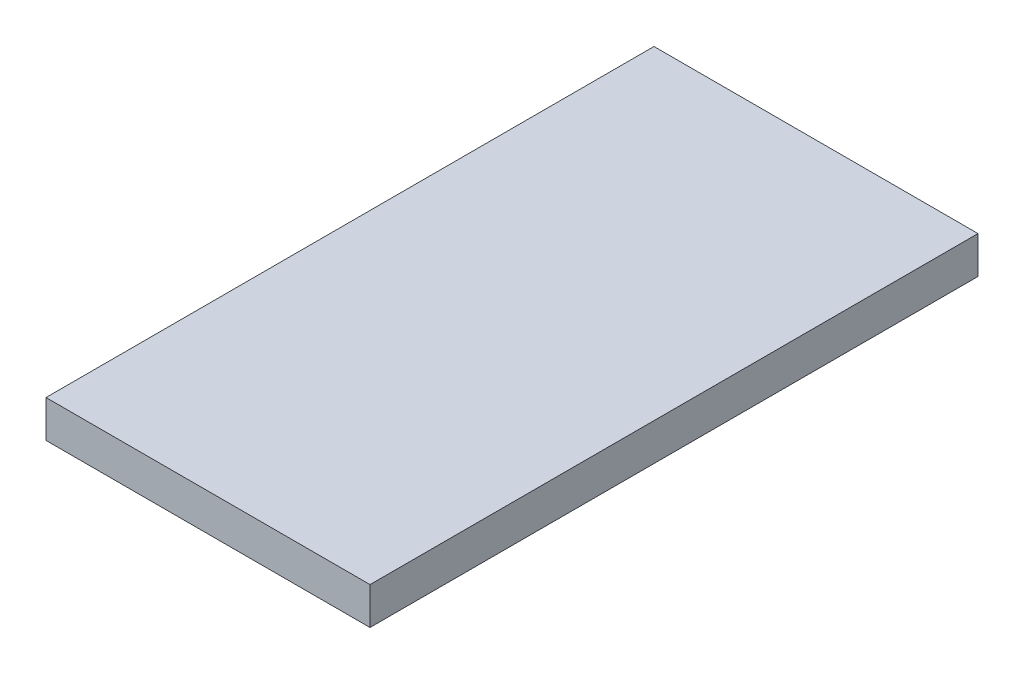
ISO-10303-21;
HEADER;
FILE_DESCRIPTION(('STEP AP214'),'2;1');
FILE_NAME('part.step','',(''),(''),'','','');
FILE_SCHEMA(('AUTOMOTIVE_DESIGN { 1 0 10303 214 1 1 1 1 }'));
ENDSEC;
DATA;
#1=APPLICATION_CONTEXT('core data for automotive mechanical design processes');
#2=APPLICATION_PROTOCOL_DEFINITION('international standard','automotive_design',2000,#1);
#3=PRODUCT_CONTEXT('',#1,'mechanical');
#4=PRODUCT('Part','Part','',(#3));
#5=PRODUCT_RELATED_PRODUCT_CATEGORY('part','',(#4));
#6=PRODUCT_DEFINITION_FORMATION('','',#4);
#7=PRODUCT_DEFINITION_CONTEXT('part definition',#1,'design');
#8=PRODUCT_DEFINITION('design','',#6,#7);
#9=PRODUCT_DEFINITION_SHAPE('','',#8);
#10=(LENGTH_UNIT() NAMED_UNIT(*) SI_UNIT(.MILLI.,.METRE.));
#11=(NAMED_UNIT(*) PLANE_ANGLE_UNIT() SI_UNIT($,.RADIAN.));
#12=(NAMED_UNIT(*) SI_UNIT($,.STERADIAN.) SOLID_ANGLE_UNIT());
#13=UNCERTAINTY_MEASURE_WITH_UNIT(LENGTH_MEASURE(1.E-05),#10,'distance_accuracy_value','');
#14=(GEOMETRIC_REPRESENTATION_CONTEXT(3) GLOBAL_UNCERTAINTY_ASSIGNED_CONTEXT((#13)) GLOBAL_UNIT_ASSIGNED_CONTEXT((#10,
#11,#12)) REPRESENTATION_CONTEXT('',''));
#15=CARTESIAN_POINT('',(0.,0.,0.));
#16=DIRECTION('',(0.,0.,1.));
#17=DIRECTION('',(1.,0.,0.));
#18=AXIS2_PLACEMENT_3D('',#15,#16,#17);
#19=CARTESIAN_POINT('',(22.66,2.6,-42.52));
#20=DIRECTION('',(0.,0.,1.));
#21=DIRECTION('',(1.,0.,0.));
#22=AXIS2_PLACEMENT_3D('',#19,#20,#21);
#23=PLANE('',#22);
#24=DIRECTION('',(-1.,0.,0.));
#25=VECTOR('',#24,1.);
#26=CARTESIAN_POINT('',(22.66,-2.6,-42.52));
#27=LINE('',#26,#25);
#28=CARTESIAN_POINT('',(22.66,-2.6,-42.52));
#29=VERTEX_POINT('',#28);
#30=CARTESIAN_POINT('',(-22.66,-2.6,-42.52));
#31=VERTEX_POINT('',#30);
#32=EDGE_CURVE('E105',#29,#31,#27,.T.);
#33=ORIENTED_EDGE('',*,*,#32,.T.);
#34=DIRECTION('',(0.,-1.,0.));
#35=VECTOR('',#34,1.);
#36=CARTESIAN_POINT('',(-22.66,2.6,-42.52));
#37=LINE('',#36,#35);
#38=CARTESIAN_POINT('',(-22.66,2.6,-42.52));
#39=VERTEX_POINT('',#38);
#40=EDGE_CURVE('E11',#39,#31,#37,.T.);
#41=ORIENTED_EDGE('',*,*,#40,.F.);
#42=DIRECTION('',(-1.,0.,0.));
#43=VECTOR('',#42,1.);
#44=CARTESIAN_POINT('',(22.66,2.6,-42.52));
#45=LINE('',#44,#43);
#46=CARTESIAN_POINT('',(22.66,2.6,-42.52));
#47=VERTEX_POINT('',#46);
#48=EDGE_CURVE('E82',#47,#39,#45,.T.);
#49=ORIENTED_EDGE('',*,*,#48,.F.);
#50=DIRECTION('',(0.,-1.,0.));
#51=VECTOR('',#50,1.);
#52=CARTESIAN_POINT('',(22.66,2.6,-42.52));
#53=LINE('',#52,#51);
#54=EDGE_CURVE('E101',#47,#29,#53,.T.);
#55=ORIENTED_EDGE('',*,*,#54,.T.);
#56=EDGE_LOOP('',(#33,#41,#49,#55));
#57=FACE_BOUND('',#56,.T.);
#58=ADVANCED_FACE('F43',(#57),#23,.F.);
#59=CARTESIAN_POINT('',(-22.66,2.6,42.52));
#60=DIRECTION('',(-1.,0.,0.));
#61=DIRECTION('',(0.,0.,1.));
#62=AXIS2_PLACEMENT_3D('',#59,#60,#61);
#63=PLANE('',#62);
#64=DIRECTION('',(0.,0.,-1.));
#65=VECTOR('',#64,1.);
#66=CARTESIAN_POINT('',(-22.66,-2.6,42.52));
#67=LINE('',#66,#65);
#68=CARTESIAN_POINT('',(-22.66,-2.6,42.52));
#69=VERTEX_POINT('',#68);
#70=EDGE_CURVE('E91',#69,#31,#67,.T.);
#71=ORIENTED_EDGE('',*,*,#70,.F.);
#72=DIRECTION('',(0.,-1.,0.));
#73=VECTOR('',#72,1.);
#74=CARTESIAN_POINT('',(-22.66,2.6,42.52));
#75=LINE('',#74,#73);
#76=CARTESIAN_POINT('',(-22.66,2.6,42.52));
#77=VERTEX_POINT('',#76);
#78=EDGE_CURVE('E51',#77,#69,#75,.T.);
#79=ORIENTED_EDGE('',*,*,#78,.F.);
#80=DIRECTION('',(0.,0.,-1.));
#81=VECTOR('',#80,1.);
#82=CARTESIAN_POINT('',(-22.66,2.6,42.52));
#83=LINE('',#82,#81);
#84=EDGE_CURVE('E89',#77,#39,#83,.T.);
#85=ORIENTED_EDGE('',*,*,#84,.T.);
#86=ORIENTED_EDGE('',*,*,#40,.T.);
#87=EDGE_LOOP('',(#71,#79,#85,#86));
#88=FACE_BOUND('',#87,.T.);
#89=ADVANCED_FACE('F88',(#88),#63,.T.);
#90=CARTESIAN_POINT('',(22.66,2.6,42.52));
#91=DIRECTION('',(0.,0.,1.));
#92=DIRECTION('',(1.,0.,0.));
#93=AXIS2_PLACEMENT_3D('',#90,#91,#92);
#94=PLANE('',#93);
#95=DIRECTION('',(-1.,0.,0.));
#96=VECTOR('',#95,1.);
#97=CARTESIAN_POINT('',(22.66,-2.6,42.52));
#98=LINE('',#97,#96);
#99=CARTESIAN_POINT('',(22.66,-2.6,42.52));
#100=VERTEX_POINT('',#99);
#101=EDGE_CURVE('E109',#100,#69,#98,.T.);
#102=ORIENTED_EDGE('',*,*,#101,.F.);
#103=DIRECTION('',(0.,-1.,0.));
#104=VECTOR('',#103,1.);
#105=CARTESIAN_POINT('',(22.66,2.6,42.52));
#106=LINE('',#105,#104);
#107=CARTESIAN_POINT('',(22.66,2.6,42.52));
#108=VERTEX_POINT('',#107);
#109=EDGE_CURVE('E74',#108,#100,#106,.T.);
#110=ORIENTED_EDGE('',*,*,#109,.F.);
#111=DIRECTION('',(-1.,0.,0.));
#112=VECTOR('',#111,1.);
#113=CARTESIAN_POINT('',(22.66,2.6,42.52));
#114=LINE('',#113,#112);
#115=EDGE_CURVE('E97',#108,#77,#114,.T.);
#116=ORIENTED_EDGE('',*,*,#115,.T.);
#117=ORIENTED_EDGE('',*,*,#78,.T.);
#118=EDGE_LOOP('',(#102,#110,#116,#117));
#119=FACE_BOUND('',#118,.T.);
#120=ADVANCED_FACE('F99',(#119),#94,.T.);
#121=CARTESIAN_POINT('',(22.66,2.6,42.52));
#122=DIRECTION('',(-1.,0.,0.));
#123=DIRECTION('',(0.,0.,1.));
#124=AXIS2_PLACEMENT_3D('',#121,#122,#123);
#125=PLANE('',#124);
#126=DIRECTION('',(0.,0.,-1.));
#127=VECTOR('',#126,1.);
#128=CARTESIAN_POINT('',(22.66,-2.6,42.52));
#129=LINE('',#128,#127);
#130=EDGE_CURVE('E77',#100,#29,#129,.T.);
#131=ORIENTED_EDGE('',*,*,#130,.T.);
#132=ORIENTED_EDGE('',*,*,#54,.F.);
#133=DIRECTION('',(0.,0.,-1.));
#134=VECTOR('',#133,1.);
#135=CARTESIAN_POINT('',(22.66,2.6,42.52));
#136=LINE('',#135,#134);
#137=EDGE_CURVE('E59',#108,#47,#136,.T.);
#138=ORIENTED_EDGE('',*,*,#137,.F.);
#139=ORIENTED_EDGE('',*,*,#109,.T.);
#140=EDGE_LOOP('',(#131,#132,#138,#139));
#141=FACE_BOUND('',#140,.T.);
#142=ADVANCED_FACE('F122',(#141),#125,.F.);
#143=CARTESIAN_POINT('',(0.,2.6,0.));
#144=DIRECTION('',(0.,-1.,0.));
#145=DIRECTION('',(0.,0.,-1.));
#146=AXIS2_PLACEMENT_3D('',#143,#144,#145);
#147=PLANE('',#146);
#148=ORIENTED_EDGE('',*,*,#48,.T.);
#149=ORIENTED_EDGE('',*,*,#84,.F.);
#150=ORIENTED_EDGE('',*,*,#115,.F.);
#151=ORIENTED_EDGE('',*,*,#137,.T.);
#152=EDGE_LOOP('',(#148,#149,#150,#151));
#153=FACE_BOUND('',#152,.T.);
#154=ADVANCED_FACE('F96',(#153),#147,.F.);
#155=CARTESIAN_POINT('',(0.,-2.6,0.));
#156=DIRECTION('',(0.,-1.,0.));
#157=DIRECTION('',(0.,0.,-1.));
#158=AXIS2_PLACEMENT_3D('',#155,#156,#157);
#159=PLANE('',#158);
#160=ORIENTED_EDGE('',*,*,#32,.F.);
#161=ORIENTED_EDGE('',*,*,#130,.F.);
#162=ORIENTED_EDGE('',*,*,#101,.T.);
#163=ORIENTED_EDGE('',*,*,#70,.T.);
#164=EDGE_LOOP('',(#160,#161,#162,#163));
#165=FACE_BOUND('',#164,.T.);
#166=ADVANCED_FACE('F116',(#165),#159,.T.);
#167=CLOSED_SHELL('',(#58,#89,#120,#142,#154,#166));
#168=MANIFOLD_SOLID_BREP('B2',#167);
#169=ADVANCED_BREP_SHAPE_REPRESENTATION('',(#18,#168),#14);
#170=SHAPE_DEFINITION_REPRESENTATION(#9,#169);
ENDSEC;
END-ISO-10303-21;
